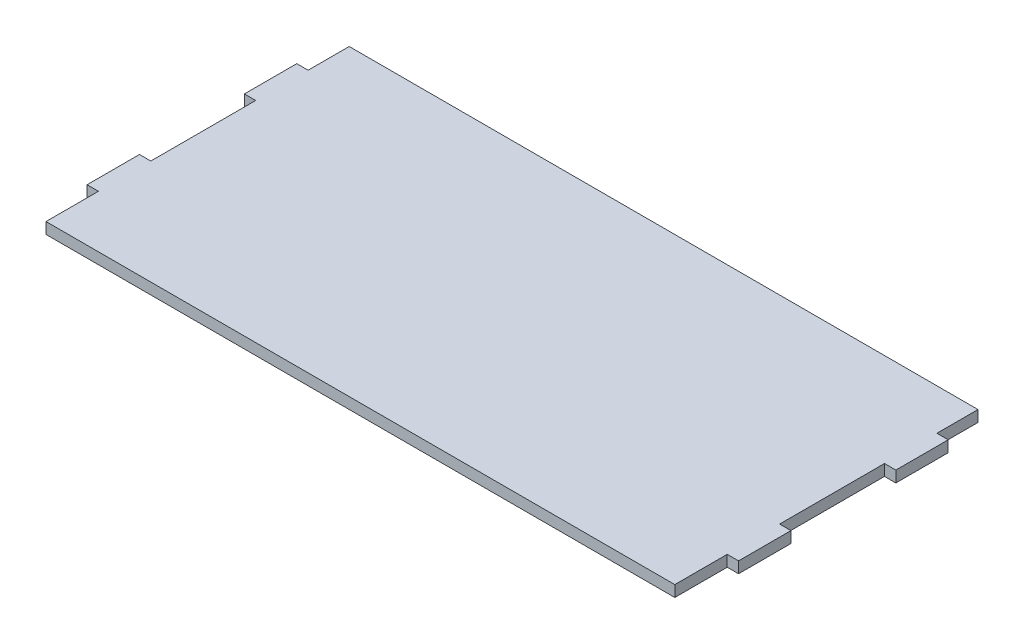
from build123d import *

# Parameters (mm, degrees)
BOSS_EXTRUDE1_DEPTH = 16.30000042


with BuildPart() as part:
    # Sketch1 → Boss-Extrude1 (new body)
    with BuildSketch(Plane(origin=(0, 0, 0), x_dir=(1, 0, 0), z_dir=(0, 1, 0))):
        Polygon((0.332647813, 305.806810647), (-16.145106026, 305.806810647), (-16.145106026, 229.606810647), (0.332647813, 229.606810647), (0.332647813, 77.072140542), (-16.149513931, 77.072140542), (-16.149513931, 0.872140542), (0.332647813, 0.872140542), (0.332647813, -75.345236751), (914.732647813, -75.345236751), (914.732647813, 0.872140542), (931.214809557, 0.872140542), (931.214809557, 77.072140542), (914.732647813, 77.072140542), (914.732647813, 229.606810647), (931.210401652, 229.606810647), (931.210401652, 305.806810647), (914.732647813, 305.806810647), (914.732647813, 365.554762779), (0.332647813, 365.554762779), align=None)
    extrude(amount=BOSS_EXTRUDE1_DEPTH)


solid = part.part
